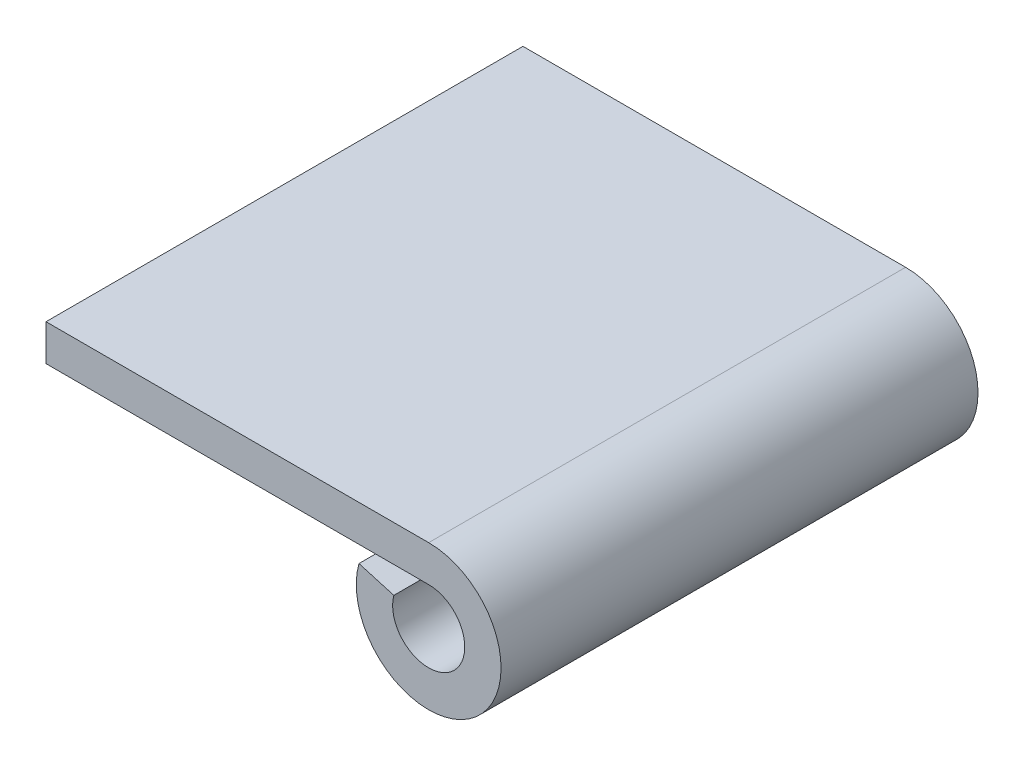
ISO-10303-21;
HEADER;
FILE_DESCRIPTION(('STEP AP214'),'2;1');
FILE_NAME('part.step','',(''),(''),'','','');
FILE_SCHEMA(('AUTOMOTIVE_DESIGN { 1 0 10303 214 1 1 1 1 }'));
ENDSEC;
DATA;
#1=APPLICATION_CONTEXT('core data for automotive mechanical design processes');
#2=APPLICATION_PROTOCOL_DEFINITION('international standard','automotive_design',2000,#1);
#3=PRODUCT_CONTEXT('',#1,'mechanical');
#4=PRODUCT('Part','Part','',(#3));
#5=PRODUCT_RELATED_PRODUCT_CATEGORY('part','',(#4));
#6=PRODUCT_DEFINITION_FORMATION('','',#4);
#7=PRODUCT_DEFINITION_CONTEXT('part definition',#1,'design');
#8=PRODUCT_DEFINITION('design','',#6,#7);
#9=PRODUCT_DEFINITION_SHAPE('','',#8);
#10=(LENGTH_UNIT() NAMED_UNIT(*) SI_UNIT(.MILLI.,.METRE.));
#11=(NAMED_UNIT(*) PLANE_ANGLE_UNIT() SI_UNIT($,.RADIAN.));
#12=(NAMED_UNIT(*) SI_UNIT($,.STERADIAN.) SOLID_ANGLE_UNIT());
#13=UNCERTAINTY_MEASURE_WITH_UNIT(LENGTH_MEASURE(1.E-05),#10,'distance_accuracy_value','');
#14=(GEOMETRIC_REPRESENTATION_CONTEXT(3) GLOBAL_UNCERTAINTY_ASSIGNED_CONTEXT((#13)) GLOBAL_UNIT_ASSIGNED_CONTEXT((#10,
#11,#12)) REPRESENTATION_CONTEXT('',''));
#15=CARTESIAN_POINT('',(0.,0.,0.));
#16=DIRECTION('',(0.,0.,1.));
#17=DIRECTION('',(1.,0.,0.));
#18=AXIS2_PLACEMENT_3D('',#15,#16,#17);
#19=CARTESIAN_POINT('',(0.,0.,17.065625));
#20=DIRECTION('',(0.,0.,-1.));
#21=DIRECTION('',(-1.,0.,0.));
#22=AXIS2_PLACEMENT_3D('',#19,#20,#21);
#23=CYLINDRICAL_SURFACE('',#22,5.1796875);
#24=CARTESIAN_POINT('',(0.,0.,-17.065625));
#25=DIRECTION('',(0.,0.,1.));
#26=DIRECTION('',(1.,0.,0.));
#27=AXIS2_PLACEMENT_3D('',#24,#25,#26);
#28=CIRCLE('',#27,5.1796875);
#29=CARTESIAN_POINT('',(-4.98995671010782,1.3890625,-17.065625));
#30=VERTEX_POINT('',#29);
#31=CARTESIAN_POINT('',(0.,5.1796875,-17.065625));
#32=VERTEX_POINT('',#31);
#33=EDGE_CURVE('E90',#30,#32,#28,.T.);
#34=ORIENTED_EDGE('',*,*,#33,.T.);
#35=DIRECTION('',(0.,0.,-1.));
#36=VECTOR('',#35,1.);
#37=CARTESIAN_POINT('',(0.,5.1796875,17.065625));
#38=LINE('',#37,#36);
#39=CARTESIAN_POINT('',(0.,5.1796875,17.065625));
#40=VERTEX_POINT('',#39);
#41=EDGE_CURVE('E10',#40,#32,#38,.T.);
#42=ORIENTED_EDGE('',*,*,#41,.F.);
#43=CARTESIAN_POINT('',(0.,0.,17.065625));
#44=DIRECTION('',(0.,0.,1.));
#45=DIRECTION('',(1.,0.,0.));
#46=AXIS2_PLACEMENT_3D('',#43,#44,#45);
#47=CIRCLE('',#46,5.1796875);
#48=CARTESIAN_POINT('',(-4.98995671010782,1.3890625,17.065625));
#49=VERTEX_POINT('',#48);
#50=EDGE_CURVE('E119',#49,#40,#47,.T.);
#51=ORIENTED_EDGE('',*,*,#50,.F.);
#52=DIRECTION('',(0.,0.,-1.));
#53=VECTOR('',#52,1.);
#54=CARTESIAN_POINT('',(-4.98995671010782,1.3890625,17.065625));
#55=LINE('',#54,#53);
#56=EDGE_CURVE('E104',#49,#30,#55,.T.);
#57=ORIENTED_EDGE('',*,*,#56,.T.);
#58=EDGE_LOOP('',(#34,#42,#51,#57));
#59=FACE_BOUND('',#58,.T.);
#60=ADVANCED_FACE('F16',(#59),#23,.T.);
#61=CARTESIAN_POINT('',(0.,5.1796875,17.065625));
#62=DIRECTION('',(0.,-1.,0.));
#63=DIRECTION('',(1.,0.,0.));
#64=AXIS2_PLACEMENT_3D('',#61,#62,#63);
#65=PLANE('',#64);
#66=DIRECTION('',(-1.,0.,0.));
#67=VECTOR('',#66,1.);
#68=CARTESIAN_POINT('',(0.,5.1796875,-17.065625));
#69=LINE('',#68,#67);
#70=CARTESIAN_POINT('',(-27.384375,5.1796875,-17.065625));
#71=VERTEX_POINT('',#70);
#72=EDGE_CURVE('E86',#32,#71,#69,.T.);
#73=ORIENTED_EDGE('',*,*,#72,.T.);
#74=DIRECTION('',(0.,0.,-1.));
#75=VECTOR('',#74,1.);
#76=CARTESIAN_POINT('',(-27.384375,5.1796875,17.065625));
#77=LINE('',#76,#75);
#78=CARTESIAN_POINT('',(-27.384375,5.1796875,17.065625));
#79=VERTEX_POINT('',#78);
#80=EDGE_CURVE('E24',#79,#71,#77,.T.);
#81=ORIENTED_EDGE('',*,*,#80,.F.);
#82=DIRECTION('',(-1.,0.,0.));
#83=VECTOR('',#82,1.);
#84=CARTESIAN_POINT('',(0.,5.1796875,17.065625));
#85=LINE('',#84,#83);
#86=EDGE_CURVE('E100',#40,#79,#85,.T.);
#87=ORIENTED_EDGE('',*,*,#86,.F.);
#88=ORIENTED_EDGE('',*,*,#41,.T.);
#89=EDGE_LOOP('',(#73,#81,#87,#88));
#90=FACE_BOUND('',#89,.T.);
#91=ADVANCED_FACE('F99',(#90),#65,.F.);
#92=CARTESIAN_POINT('',(-27.384375,5.1796875,17.065625));
#93=DIRECTION('',(1.,0.,0.));
#94=DIRECTION('',(0.,1.,0.));
#95=AXIS2_PLACEMENT_3D('',#92,#93,#94);
#96=PLANE('',#95);
#97=DIRECTION('',(0.,-1.,0.));
#98=VECTOR('',#97,1.);
#99=CARTESIAN_POINT('',(-27.384375,5.1796875,-17.065625));
#100=LINE('',#99,#98);
#101=CARTESIAN_POINT('',(-27.384375,2.5796875,-17.065625));
#102=VERTEX_POINT('',#101);
#103=EDGE_CURVE('E92',#71,#102,#100,.T.);
#104=ORIENTED_EDGE('',*,*,#103,.T.);
#105=DIRECTION('',(0.,0.,-1.));
#106=VECTOR('',#105,1.);
#107=CARTESIAN_POINT('',(-27.384375,2.5796875,17.065625));
#108=LINE('',#107,#106);
#109=CARTESIAN_POINT('',(-27.384375,2.5796875,17.065625));
#110=VERTEX_POINT('',#109);
#111=EDGE_CURVE('E144',#110,#102,#108,.T.);
#112=ORIENTED_EDGE('',*,*,#111,.F.);
#113=DIRECTION('',(0.,-1.,0.));
#114=VECTOR('',#113,1.);
#115=CARTESIAN_POINT('',(-27.384375,5.1796875,17.065625));
#116=LINE('',#115,#114);
#117=EDGE_CURVE('E124',#79,#110,#116,.T.);
#118=ORIENTED_EDGE('',*,*,#117,.F.);
#119=ORIENTED_EDGE('',*,*,#80,.T.);
#120=EDGE_LOOP('',(#104,#112,#118,#119));
#121=FACE_BOUND('',#120,.T.);
#122=ADVANCED_FACE('F151',(#121),#96,.F.);
#123=CARTESIAN_POINT('',(-27.384375,2.5796875,17.065625));
#124=DIRECTION('',(0.,1.,0.));
#125=DIRECTION('',(0.,0.,1.));
#126=AXIS2_PLACEMENT_3D('',#123,#124,#125);
#127=PLANE('',#126);
#128=DIRECTION('',(1.,0.,0.));
#129=VECTOR('',#128,1.);
#130=CARTESIAN_POINT('',(-27.384375,2.5796875,-17.065625));
#131=LINE('',#130,#129);
#132=CARTESIAN_POINT('',(0.,2.5796875,-17.065625));
#133=VERTEX_POINT('',#132);
#134=EDGE_CURVE('E110',#102,#133,#131,.T.);
#135=ORIENTED_EDGE('',*,*,#134,.T.);
#136=DIRECTION('',(0.,0.,-1.));
#137=VECTOR('',#136,1.);
#138=CARTESIAN_POINT('',(0.,2.5796875,17.065625));
#139=LINE('',#138,#137);
#140=CARTESIAN_POINT('',(0.,2.5796875,17.065625));
#141=VERTEX_POINT('',#140);
#142=EDGE_CURVE('E140',#141,#133,#139,.T.);
#143=ORIENTED_EDGE('',*,*,#142,.F.);
#144=DIRECTION('',(1.,0.,0.));
#145=VECTOR('',#144,1.);
#146=CARTESIAN_POINT('',(-27.384375,2.5796875,17.065625));
#147=LINE('',#146,#145);
#148=EDGE_CURVE('E127',#110,#141,#147,.T.);
#149=ORIENTED_EDGE('',*,*,#148,.F.);
#150=ORIENTED_EDGE('',*,*,#111,.T.);
#151=EDGE_LOOP('',(#135,#143,#149,#150));
#152=FACE_BOUND('',#151,.T.);
#153=ADVANCED_FACE('F157',(#152),#127,.F.);
#154=CARTESIAN_POINT('',(0.,0.,17.065625));
#155=DIRECTION('',(0.,0.,-1.));
#156=DIRECTION('',(-1.,0.,0.));
#157=AXIS2_PLACEMENT_3D('',#154,#155,#156);
#158=CYLINDRICAL_SURFACE('',#157,2.5796875);
#159=CARTESIAN_POINT('',(0.,0.,-17.065625));
#160=DIRECTION('',(0.,0.,-1.));
#161=DIRECTION('',(1.,0.,0.));
#162=AXIS2_PLACEMENT_3D('',#159,#160,#161);
#163=CIRCLE('',#162,2.5796875);
#164=CARTESIAN_POINT('',(-2.49126914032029,0.669601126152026,-17.065625));
#165=VERTEX_POINT('',#164);
#166=EDGE_CURVE('E113',#133,#165,#163,.T.);
#167=ORIENTED_EDGE('',*,*,#166,.T.);
#168=DIRECTION('',(0.,0.,-1.));
#169=VECTOR('',#168,1.);
#170=CARTESIAN_POINT('',(-2.49126914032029,0.669601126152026,17.065625));
#171=LINE('',#170,#169);
#172=CARTESIAN_POINT('',(-2.49126914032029,0.669601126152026,17.065625));
#173=VERTEX_POINT('',#172);
#174=EDGE_CURVE('E136',#173,#165,#171,.T.);
#175=ORIENTED_EDGE('',*,*,#174,.F.);
#176=CARTESIAN_POINT('',(0.,0.,17.065625));
#177=DIRECTION('',(0.,0.,-1.));
#178=DIRECTION('',(1.,0.,0.));
#179=AXIS2_PLACEMENT_3D('',#176,#177,#178);
#180=CIRCLE('',#179,2.5796875);
#181=EDGE_CURVE('E43',#141,#173,#180,.T.);
#182=ORIENTED_EDGE('',*,*,#181,.F.);
#183=ORIENTED_EDGE('',*,*,#142,.T.);
#184=EDGE_LOOP('',(#167,#175,#182,#183));
#185=FACE_BOUND('',#184,.T.);
#186=ADVANCED_FACE('F160',(#185),#158,.F.);
#187=CARTESIAN_POINT('',(-4.98995671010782,1.3890625,17.065625));
#188=DIRECTION('',(-0.276694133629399,-0.960958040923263,0.));
#189=DIRECTION('',(0.960958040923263,-0.276694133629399,0.));
#190=AXIS2_PLACEMENT_3D('',#187,#188,#189);
#191=PLANE('',#190);
#192=DIRECTION('',(-0.960958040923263,0.276694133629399,0.));
#193=VECTOR('',#192,1.);
#194=CARTESIAN_POINT('',(-4.98995671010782,1.3890625,-17.065625));
#195=LINE('',#194,#193);
#196=EDGE_CURVE('E116',#165,#30,#195,.T.);
#197=ORIENTED_EDGE('',*,*,#196,.T.);
#198=ORIENTED_EDGE('',*,*,#56,.F.);
#199=DIRECTION('',(-0.960958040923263,0.276694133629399,0.));
#200=VECTOR('',#199,1.);
#201=CARTESIAN_POINT('',(-4.98995671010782,1.3890625,17.065625));
#202=LINE('',#201,#200);
#203=EDGE_CURVE('E36',#173,#49,#202,.T.);
#204=ORIENTED_EDGE('',*,*,#203,.F.);
#205=ORIENTED_EDGE('',*,*,#174,.T.);
#206=EDGE_LOOP('',(#197,#198,#204,#205));
#207=FACE_BOUND('',#206,.T.);
#208=ADVANCED_FACE('F162',(#207),#191,.F.);
#209=CARTESIAN_POINT('',(0.,0.,17.065625));
#210=DIRECTION('',(0.,0.,1.));
#211=DIRECTION('',(1.,0.,0.));
#212=AXIS2_PLACEMENT_3D('',#209,#210,#211);
#213=PLANE('',#212);
#214=ORIENTED_EDGE('',*,*,#50,.T.);
#215=ORIENTED_EDGE('',*,*,#86,.T.);
#216=ORIENTED_EDGE('',*,*,#117,.T.);
#217=ORIENTED_EDGE('',*,*,#148,.T.);
#218=ORIENTED_EDGE('',*,*,#181,.T.);
#219=ORIENTED_EDGE('',*,*,#203,.T.);
#220=EDGE_LOOP('',(#214,#215,#216,#217,#218,#219));
#221=FACE_BOUND('',#220,.T.);
#222=ADVANCED_FACE('F154',(#221),#213,.T.);
#223=CARTESIAN_POINT('',(0.,0.,-17.065625));
#224=DIRECTION('',(0.,0.,1.));
#225=DIRECTION('',(1.,0.,0.));
#226=AXIS2_PLACEMENT_3D('',#223,#224,#225);
#227=PLANE('',#226);
#228=ORIENTED_EDGE('',*,*,#33,.F.);
#229=ORIENTED_EDGE('',*,*,#196,.F.);
#230=ORIENTED_EDGE('',*,*,#166,.F.);
#231=ORIENTED_EDGE('',*,*,#134,.F.);
#232=ORIENTED_EDGE('',*,*,#103,.F.);
#233=ORIENTED_EDGE('',*,*,#72,.F.);
#234=EDGE_LOOP('',(#228,#229,#230,#231,#232,#233));
#235=FACE_BOUND('',#234,.T.);
#236=ADVANCED_FACE('F87',(#235),#227,.F.);
#237=CLOSED_SHELL('',(#60,#91,#122,#153,#186,#208,#222,#236));
#238=MANIFOLD_SOLID_BREP('B1',#237);
#239=ADVANCED_BREP_SHAPE_REPRESENTATION('',(#18,#238),#14);
#240=SHAPE_DEFINITION_REPRESENTATION(#9,#239);
ENDSEC;
END-ISO-10303-21;
